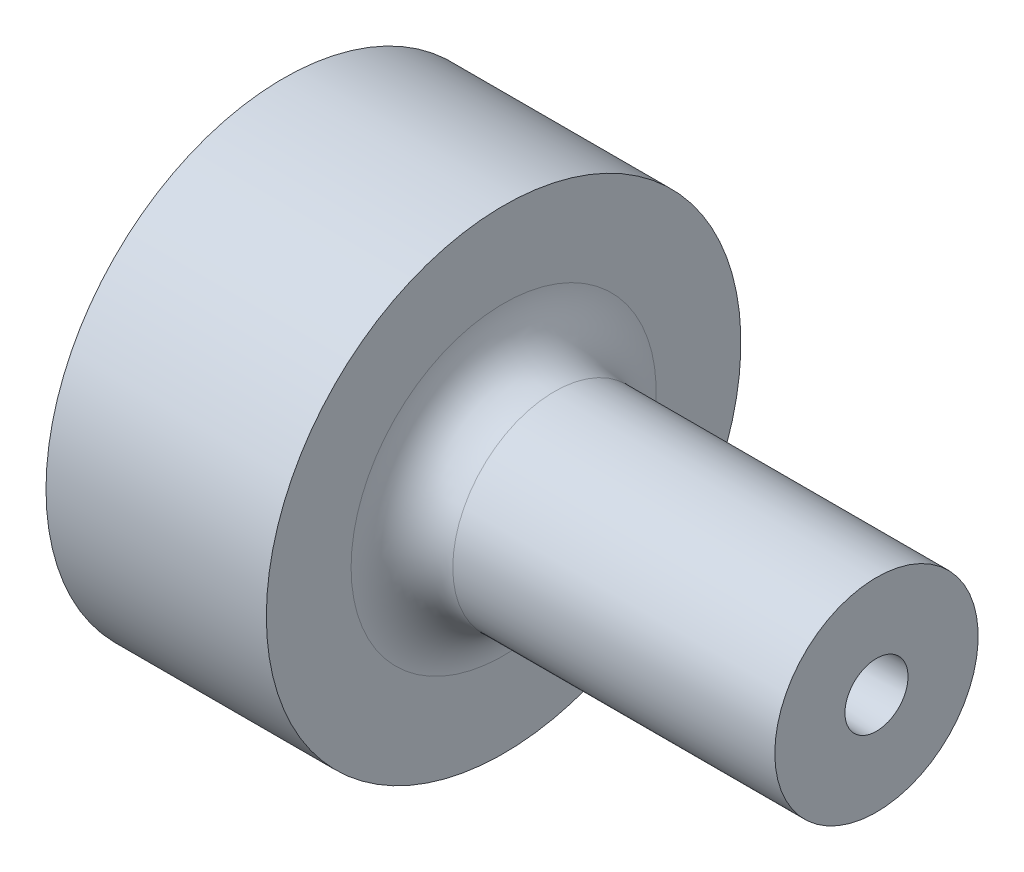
ISO-10303-21;
HEADER;
FILE_DESCRIPTION(('STEP AP214'),'2;1');
FILE_NAME('part.step','',(''),(''),'','','');
FILE_SCHEMA(('AUTOMOTIVE_DESIGN { 1 0 10303 214 1 1 1 1 }'));
ENDSEC;
DATA;
#1=APPLICATION_CONTEXT('core data for automotive mechanical design processes');
#2=APPLICATION_PROTOCOL_DEFINITION('international standard','automotive_design',2000,#1);
#3=PRODUCT_CONTEXT('',#1,'mechanical');
#4=PRODUCT('Part','Part','',(#3));
#5=PRODUCT_RELATED_PRODUCT_CATEGORY('part','',(#4));
#6=PRODUCT_DEFINITION_FORMATION('','',#4);
#7=PRODUCT_DEFINITION_CONTEXT('part definition',#1,'design');
#8=PRODUCT_DEFINITION('design','',#6,#7);
#9=PRODUCT_DEFINITION_SHAPE('','',#8);
#10=(LENGTH_UNIT() NAMED_UNIT(*) SI_UNIT(.MILLI.,.METRE.));
#11=(NAMED_UNIT(*) PLANE_ANGLE_UNIT() SI_UNIT($,.RADIAN.));
#12=(NAMED_UNIT(*) SI_UNIT($,.STERADIAN.) SOLID_ANGLE_UNIT());
#13=UNCERTAINTY_MEASURE_WITH_UNIT(LENGTH_MEASURE(1.E-05),#10,'distance_accuracy_value','');
#14=(GEOMETRIC_REPRESENTATION_CONTEXT(3) GLOBAL_UNCERTAINTY_ASSIGNED_CONTEXT((#13)) GLOBAL_UNIT_ASSIGNED_CONTEXT((#10,
#11,#12)) REPRESENTATION_CONTEXT('',''));
#15=CARTESIAN_POINT('',(0.,0.,0.));
#16=DIRECTION('',(0.,0.,1.));
#17=DIRECTION('',(1.,0.,0.));
#18=AXIS2_PLACEMENT_3D('',#15,#16,#17);
#19=CARTESIAN_POINT('',(0.,0.,0.));
#20=DIRECTION('',(-1.,0.,0.));
#21=DIRECTION('',(0.,0.,1.));
#22=AXIS2_PLACEMENT_3D('',#19,#20,#21);
#23=CYLINDRICAL_SURFACE('',#22,14.);
#24=CARTESIAN_POINT('',(13.,0.,0.));
#25=DIRECTION('',(-1.,0.,0.));
#26=DIRECTION('',(0.,0.,1.));
#27=AXIS2_PLACEMENT_3D('',#24,#25,#26);
#28=CIRCLE('',#27,14.);
#29=CARTESIAN_POINT('',(13.,0.,14.));
#30=VERTEX_POINT('',#29);
#31=EDGE_CURVE('E88',#30,#30,#28,.T.);
#32=ORIENTED_EDGE('',*,*,#31,.T.);
#33=EDGE_LOOP('',(#32));
#34=FACE_BOUND('',#33,.T.);
#35=CARTESIAN_POINT('',(0.,0.,0.));
#36=DIRECTION('',(-1.,0.,0.));
#37=DIRECTION('',(0.,0.,1.));
#38=AXIS2_PLACEMENT_3D('',#35,#36,#37);
#39=CIRCLE('',#38,14.);
#40=CARTESIAN_POINT('',(0.,0.,14.));
#41=VERTEX_POINT('',#40);
#42=EDGE_CURVE('E83',#41,#41,#39,.T.);
#43=ORIENTED_EDGE('',*,*,#42,.F.);
#44=EDGE_LOOP('',(#43));
#45=FACE_BOUND('',#44,.T.);
#46=CARTESIAN_POINT('',(6.5,-13.856406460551,-2.));
#47=CARTESIAN_POINT('',(6.61172417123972,-13.8564082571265,-1.99999534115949));
#48=CARTESIAN_POINT('',(6.72351471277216,-13.8577723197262,-1.99060664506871));
#49=CARTESIAN_POINT('',(6.9439746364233,-13.8630779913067,-1.95330740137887));
#50=CARTESIAN_POINT('',(7.05264079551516,-13.8670221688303,-1.92537839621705));
#51=CARTESIAN_POINT('',(7.26362870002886,-13.8770324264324,-1.85184738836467));
#52=CARTESIAN_POINT('',(7.36595507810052,-13.8830969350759,-1.80625847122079));
#53=CARTESIAN_POINT('',(7.56148972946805,-13.8966626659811,-1.69873175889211));
#54=CARTESIAN_POINT('',(7.65469934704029,-13.9041636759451,-1.63679637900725));
#55=CARTESIAN_POINT('',(7.83004829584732,-13.9198182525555,-1.49785346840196));
#56=CARTESIAN_POINT('',(7.91211171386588,-13.9279757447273,-1.42075056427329));
#57=CARTESIAN_POINT('',(8.06218155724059,-13.9439890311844,-1.25386707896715));
#58=CARTESIAN_POINT('',(8.13018723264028,-13.9518448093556,-1.16408582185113));
#59=CARTESIAN_POINT('',(8.25048909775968,-13.9664103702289,-0.973910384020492));
#60=CARTESIAN_POINT('',(8.30271571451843,-13.9731150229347,-0.873471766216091));
#61=CARTESIAN_POINT('',(8.38953073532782,-13.9845795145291,-0.665136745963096));
#62=CARTESIAN_POINT('',(8.4241199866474,-13.9893394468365,-0.557240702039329));
#63=CARTESIAN_POINT('',(8.47444920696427,-13.9963505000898,-0.337834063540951));
#64=CARTESIAN_POINT('',(8.49031606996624,-13.9986185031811,-0.226353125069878));
#65=CARTESIAN_POINT('',(8.5031438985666,-14.0004479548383,-0.00228956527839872));
#66=CARTESIAN_POINT('',(8.50010582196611,-14.0000095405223,0.110292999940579));
#67=CARTESIAN_POINT('',(8.47531062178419,-13.9964890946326,0.33249899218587));
#68=CARTESIAN_POINT('',(8.45369000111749,-13.9934263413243,0.442137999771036));
#69=CARTESIAN_POINT('',(8.39255744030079,-13.9850228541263,0.656215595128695));
#70=CARTESIAN_POINT('',(8.3530450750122,-13.9796820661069,0.760654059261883));
#71=CARTESIAN_POINT('',(8.25710925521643,-13.9672894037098,0.961781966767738));
#72=CARTESIAN_POINT('',(8.20062784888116,-13.9602316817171,1.05844339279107));
#73=CARTESIAN_POINT('',(8.07239950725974,-13.9451926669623,1.24096782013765));
#74=CARTESIAN_POINT('',(8.00065165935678,-13.9372113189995,1.32683017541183));
#75=CARTESIAN_POINT('',(7.843165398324,-13.921132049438,1.48612299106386));
#76=CARTESIAN_POINT('',(7.75730786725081,-13.9130337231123,1.55943569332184));
#77=CARTESIAN_POINT('',(7.57444547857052,-13.8977029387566,1.69062989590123));
#78=CARTESIAN_POINT('',(7.47744056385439,-13.890470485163,1.74851131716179));
#79=CARTESIAN_POINT('',(7.27491971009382,-13.8776905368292,1.84721301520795));
#80=CARTESIAN_POINT('',(7.1693981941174,-13.8721441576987,1.88802200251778));
#81=CARTESIAN_POINT('',(6.95290242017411,-13.8633846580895,1.9513062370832));
#82=CARTESIAN_POINT('',(6.84192850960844,-13.8601713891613,1.97378265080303));
#83=CARTESIAN_POINT('',(6.61872346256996,-13.8564698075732,1.99960390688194));
#84=CARTESIAN_POINT('',(6.50651197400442,-13.8559577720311,2.00311531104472));
#85=CARTESIAN_POINT('',(6.28310219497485,-13.8576537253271,1.9913480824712));
#86=CARTESIAN_POINT('',(6.17190387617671,-13.8598616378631,1.9760699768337));
#87=CARTESIAN_POINT('',(5.95418781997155,-13.8667269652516,1.92729837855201));
#88=CARTESIAN_POINT('',(5.84765127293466,-13.8713733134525,1.8938871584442));
#89=CARTESIAN_POINT('',(5.6416912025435,-13.8825829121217,1.80988306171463));
#90=CARTESIAN_POINT('',(5.54226800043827,-13.8891462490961,1.75928940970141));
#91=CARTESIAN_POINT('',(5.35260812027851,-13.9035064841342,1.64195360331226));
#92=CARTESIAN_POINT('',(5.26243903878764,-13.911311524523,1.57510320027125));
#93=CARTESIAN_POINT('',(5.09454027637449,-13.9272509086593,1.42730277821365));
#94=CARTESIAN_POINT('',(5.01681123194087,-13.9353852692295,1.34635203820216));
#95=CARTESIAN_POINT('',(4.8754047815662,-13.9511405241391,1.17191708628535));
#96=CARTESIAN_POINT('',(4.81183747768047,-13.9587570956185,1.07834317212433));
#97=CARTESIAN_POINT('',(4.70132443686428,-13.972552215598,0.881748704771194));
#98=CARTESIAN_POINT('',(4.65437828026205,-13.9787308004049,0.778728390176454));
#99=CARTESIAN_POINT('',(4.57861788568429,-13.9889347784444,0.566515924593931));
#100=CARTESIAN_POINT('',(4.54974241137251,-13.9929674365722,0.457345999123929));
#101=CARTESIAN_POINT('',(4.51074453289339,-13.9984555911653,0.235645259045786));
#102=CARTESIAN_POINT('',(4.50062101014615,-13.9999112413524,0.123114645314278));
#103=CARTESIAN_POINT('',(4.49943976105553,-14.0000800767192,-0.101043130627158));
#104=CARTESIAN_POINT('',(4.50821318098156,-13.998817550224,-0.212669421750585));
#105=CARTESIAN_POINT('',(4.54421615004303,-13.9937406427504,-0.432842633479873));
#106=CARTESIAN_POINT('',(4.57144565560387,-13.989926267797,-0.541389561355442));
#107=CARTESIAN_POINT('',(4.6435299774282,-13.9801722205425,-0.752283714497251));
#108=CARTESIAN_POINT('',(4.68837418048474,-13.9742338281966,-0.854634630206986));
#109=CARTESIAN_POINT('',(4.79439714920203,-13.960885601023,-1.05038570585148));
#110=CARTESIAN_POINT('',(4.8555763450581,-13.9534757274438,-1.14378562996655));
#111=CARTESIAN_POINT('',(4.99314771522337,-13.9379304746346,-1.31984194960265));
#112=CARTESIAN_POINT('',(5.06966490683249,-13.9297894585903,-1.40240016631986));
#113=CARTESIAN_POINT('',(5.2354775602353,-13.9137422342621,-1.55356716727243));
#114=CARTESIAN_POINT('',(5.32477602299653,-13.9058360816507,-1.6221726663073));
#115=CARTESIAN_POINT('',(5.51414543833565,-13.8911108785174,-1.74379523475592));
#116=CARTESIAN_POINT('',(5.61426869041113,-13.8842975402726,-1.79673154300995));
#117=CARTESIAN_POINT('',(5.82203229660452,-13.8725962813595,-1.88495902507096));
#118=CARTESIAN_POINT('',(5.92966459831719,-13.8677063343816,-1.92026877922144));
#119=CARTESIAN_POINT('',(6.11483642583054,-13.8615529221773,-1.96409255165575));
#120=CARTESIAN_POINT('',(6.19122433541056,-13.859633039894,-1.97753762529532));
#121=CARTESIAN_POINT('',(6.34506419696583,-13.857059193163,-1.99549291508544));
#122=CARTESIAN_POINT('',(6.42251613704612,-13.8564052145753,-2.00000323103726));
#123=CARTESIAN_POINT('',(6.5,-13.856406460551,-2.));
#124=B_SPLINE_CURVE_WITH_KNOTS('',3,(#46,#47,#48,#49,#50,#51,#52,#53,#54,#55,#56,#57,#58,#59,
#60,#61,#62,#63,#64,#65,#66,#67,#68,#69,#70,#71,#72,#73,#74,#75,#76,#77,#78,#79,#80,#81,#82,#83,
#84,#85,#86,#87,#88,#89,#90,#91,#92,#93,#94,#95,#96,#97,#98,#99,#100,#101,#102,#103,#104,#105,
#106,#107,#108,#109,#110,#111,#112,#113,#114,#115,#116,#117,#118,#119,#120,#121,#122,#123),
.UNSPECIFIED.,.T.,.F.,(4,2,2,2,2,2,2,2,2,2,2,2,2,2,2,2,2,2,2,2,2,2,2,2,2,2,2,2,2,2,2,2,2,2,2,2,
2,2,4),(0.,0.334889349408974,0.670112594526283,1.00508792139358,1.34001378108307,
1.6771171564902,2.01423851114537,2.35282530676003,2.6913958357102,3.02765822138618,
3.36390357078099,3.69769984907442,4.03150405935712,4.36646147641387,4.70143892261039,
5.03940517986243,5.37737316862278,5.7155642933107,6.05373389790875,6.3889286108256,
6.72411392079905,7.05779100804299,7.39148315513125,7.72746121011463,8.06345644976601,
8.40197921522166,8.74049343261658,9.07785422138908,9.41519488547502,9.74953375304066,
10.083871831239,10.4180087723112,10.7521545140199,11.0891434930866,11.426211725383,
11.7649881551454,12.103406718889,12.3356645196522,12.5679197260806),.UNSPECIFIED.);
#125=CARTESIAN_POINT('',(6.5,-13.856406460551,-2.));
#126=VERTEX_POINT('',#125);
#127=EDGE_CURVE('E9',#126,#126,#124,.T.);
#128=ORIENTED_EDGE('',*,*,#127,.F.);
#129=EDGE_LOOP('',(#128));
#130=FACE_BOUND('',#129,.T.);
#131=ADVANCED_FACE('F15',(#34,#45,#130),#23,.T.);
#132=CARTESIAN_POINT('',(0.,0.,0.));
#133=DIRECTION('',(1.,0.,0.));
#134=DIRECTION('',(0.,0.,-1.));
#135=AXIS2_PLACEMENT_3D('',#132,#133,#134);
#136=CONICAL_SURFACE('',#135,1.25,0.0174532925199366);
#137=CARTESIAN_POINT('',(35.,0.,0.));
#138=DIRECTION('',(-1.,0.,0.));
#139=DIRECTION('',(0.,0.,1.));
#140=AXIS2_PLACEMENT_3D('',#137,#138,#139);
#141=CIRCLE('',#140,1.86092727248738);
#142=CARTESIAN_POINT('',(35.,0.,1.86092727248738));
#143=VERTEX_POINT('',#142);
#144=EDGE_CURVE('E80',#143,#143,#141,.T.);
#145=ORIENTED_EDGE('',*,*,#144,.F.);
#146=EDGE_LOOP('',(#145));
#147=FACE_BOUND('',#146,.T.);
#148=CARTESIAN_POINT('',(0.924407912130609,0.,0.));
#149=DIRECTION('',(-1.,0.,0.));
#150=DIRECTION('',(0.,0.,1.));
#151=AXIS2_PLACEMENT_3D('',#148,#149,#150);
#152=CIRCLE('',#151,1.26613560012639);
#153=CARTESIAN_POINT('',(0.924407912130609,0.,1.26613560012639));
#154=VERTEX_POINT('',#153);
#155=EDGE_CURVE('E93',#154,#154,#152,.F.);
#156=ORIENTED_EDGE('',*,*,#155,.F.);
#157=EDGE_LOOP('',(#156));
#158=FACE_BOUND('',#157,.T.);
#159=ADVANCED_FACE('F44',(#147,#158),#136,.F.);
#160=CARTESIAN_POINT('',(16.,0.,0.));
#161=DIRECTION('',(-1.,0.,0.));
#162=DIRECTION('',(0.,0.,1.));
#163=AXIS2_PLACEMENT_3D('',#160,#161,#162);
#164=TOROIDAL_SURFACE('',#163,9.,3.);
#165=CARTESIAN_POINT('',(13.,0.,0.));
#166=DIRECTION('',(-1.,0.,0.));
#167=DIRECTION('',(0.,0.,1.));
#168=AXIS2_PLACEMENT_3D('',#165,#166,#167);
#169=CIRCLE('',#168,9.);
#170=CARTESIAN_POINT('',(13.,0.,9.));
#171=VERTEX_POINT('',#170);
#172=EDGE_CURVE('E90',#171,#171,#169,.T.);
#173=ORIENTED_EDGE('',*,*,#172,.F.);
#174=EDGE_LOOP('',(#173));
#175=FACE_BOUND('',#174,.T.);
#176=CARTESIAN_POINT('',(16.,0.,0.));
#177=DIRECTION('',(-1.,0.,0.));
#178=DIRECTION('',(0.,0.,1.));
#179=AXIS2_PLACEMENT_3D('',#176,#177,#178);
#180=CIRCLE('',#179,6.);
#181=CARTESIAN_POINT('',(16.,0.,6.));
#182=VERTEX_POINT('',#181);
#183=EDGE_CURVE('E27',#182,#182,#180,.T.);
#184=ORIENTED_EDGE('',*,*,#183,.T.);
#185=EDGE_LOOP('',(#184));
#186=FACE_BOUND('',#185,.T.);
#187=ADVANCED_FACE('F17',(#175,#186),#164,.F.);
#188=CARTESIAN_POINT('',(0.,0.,0.));
#189=DIRECTION('',(-1.,0.,0.));
#190=DIRECTION('',(0.,0.,1.));
#191=AXIS2_PLACEMENT_3D('',#188,#189,#190);
#192=CYLINDRICAL_SURFACE('',#191,6.);
#193=ORIENTED_EDGE('',*,*,#183,.F.);
#194=EDGE_LOOP('',(#193));
#195=FACE_BOUND('',#194,.T.);
#196=CARTESIAN_POINT('',(35.,0.,0.));
#197=DIRECTION('',(-1.,0.,0.));
#198=DIRECTION('',(0.,0.,1.));
#199=AXIS2_PLACEMENT_3D('',#196,#197,#198);
#200=CIRCLE('',#199,6.);
#201=CARTESIAN_POINT('',(35.,0.,6.));
#202=VERTEX_POINT('',#201);
#203=EDGE_CURVE('E79',#202,#202,#200,.T.);
#204=ORIENTED_EDGE('',*,*,#203,.T.);
#205=EDGE_LOOP('',(#204));
#206=FACE_BOUND('',#205,.T.);
#207=ADVANCED_FACE('F65',(#195,#206),#192,.T.);
#208=CARTESIAN_POINT('',(35.,6.,0.));
#209=DIRECTION('',(-1.,0.,0.));
#210=DIRECTION('',(0.,0.,1.));
#211=AXIS2_PLACEMENT_3D('',#208,#209,#210);
#212=PLANE('',#211);
#213=ORIENTED_EDGE('',*,*,#203,.F.);
#214=EDGE_LOOP('',(#213));
#215=FACE_BOUND('',#214,.T.);
#216=ORIENTED_EDGE('',*,*,#144,.T.);
#217=EDGE_LOOP('',(#216));
#218=FACE_BOUND('',#217,.T.);
#219=ADVANCED_FACE('F61',(#215,#218),#212,.F.);
#220=CARTESIAN_POINT('',(0.,1.25,0.));
#221=DIRECTION('',(1.,0.,0.));
#222=DIRECTION('',(0.,0.,-1.));
#223=AXIS2_PLACEMENT_3D('',#220,#221,#222);
#224=PLANE('',#223);
#225=CARTESIAN_POINT('',(0.,0.,0.));
#226=DIRECTION('',(-1.,0.,0.));
#227=DIRECTION('',(0.,0.,1.));
#228=AXIS2_PLACEMENT_3D('',#225,#226,#227);
#229=CIRCLE('',#228,5.);
#230=CARTESIAN_POINT('',(0.,0.,5.));
#231=VERTEX_POINT('',#230);
#232=EDGE_CURVE('E96',#231,#231,#229,.T.);
#233=ORIENTED_EDGE('',*,*,#232,.F.);
#234=EDGE_LOOP('',(#233));
#235=FACE_BOUND('',#234,.T.);
#236=ORIENTED_EDGE('',*,*,#42,.T.);
#237=EDGE_LOOP('',(#236));
#238=FACE_BOUND('',#237,.T.);
#239=ADVANCED_FACE('F59',(#235,#238),#224,.F.);
#240=CARTESIAN_POINT('',(13.,14.,0.));
#241=DIRECTION('',(-1.,0.,0.));
#242=DIRECTION('',(0.,0.,1.));
#243=AXIS2_PLACEMENT_3D('',#240,#241,#242);
#244=PLANE('',#243);
#245=ORIENTED_EDGE('',*,*,#31,.F.);
#246=EDGE_LOOP('',(#245));
#247=FACE_BOUND('',#246,.T.);
#248=ORIENTED_EDGE('',*,*,#172,.T.);
#249=EDGE_LOOP('',(#248));
#250=FACE_BOUND('',#249,.T.);
#251=ADVANCED_FACE('F57',(#247,#250),#244,.F.);
#252=CARTESIAN_POINT('',(-14.4672767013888,0.,0.));
#253=DIRECTION('',(-1.,0.,0.));
#254=DIRECTION('',(0.,0.,1.));
#255=AXIS2_PLACEMENT_3D('',#252,#253,#254);
#256=DEGENERATE_TOROIDAL_SURFACE('',#255,0.56308411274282,15.5,.F.);
#257=ORIENTED_EDGE('',*,*,#232,.T.);
#258=EDGE_LOOP('',(#257));
#259=FACE_BOUND('',#258,.T.);
#260=ORIENTED_EDGE('',*,*,#155,.T.);
#261=EDGE_LOOP('',(#260));
#262=FACE_BOUND('',#261,.T.);
#263=ADVANCED_FACE('F40',(#259,#262),#256,.T.);
#264=CARTESIAN_POINT('',(6.5,-14.,0.));
#265=DIRECTION('',(0.,-1.,0.));
#266=DIRECTION('',(0.,0.,-1.));
#267=AXIS2_PLACEMENT_3D('',#264,#265,#266);
#268=CYLINDRICAL_SURFACE('',#267,2.);
#269=CARTESIAN_POINT('',(6.5,-8.,0.));
#270=DIRECTION('',(0.,-1.,0.));
#271=DIRECTION('',(0.,0.,-1.));
#272=AXIS2_PLACEMENT_3D('',#269,#270,#271);
#273=CIRCLE('',#272,2.);
#274=CARTESIAN_POINT('',(6.5,-8.,-2.));
#275=VERTEX_POINT('',#274);
#276=EDGE_CURVE('E99',#275,#275,#273,.T.);
#277=ORIENTED_EDGE('',*,*,#276,.F.);
#278=EDGE_LOOP('',(#277));
#279=FACE_BOUND('',#278,.T.);
#280=ORIENTED_EDGE('',*,*,#127,.T.);
#281=EDGE_LOOP('',(#280));
#282=FACE_BOUND('',#281,.T.);
#283=ADVANCED_FACE('F32',(#279,#282),#268,.F.);
#284=CARTESIAN_POINT('',(6.5,-6.84529946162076,0.));
#285=DIRECTION('',(0.,-1.,0.));
#286=DIRECTION('',(0.,0.,-1.));
#287=AXIS2_PLACEMENT_3D('',#284,#285,#286);
#288=CONICAL_SURFACE('',#287,0.,1.0471975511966);
#289=ORIENTED_EDGE('',*,*,#276,.T.);
#290=EDGE_LOOP('',(#289));
#291=FACE_BOUND('',#290,.T.);
#292=CARTESIAN_POINT('',(6.5,-6.84529946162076,0.));
#293=VERTEX_POINT('',#292);
#294=VERTEX_LOOP('',#293);
#295=FACE_BOUND('',#294,.T.);
#296=ADVANCED_FACE('F30',(#291,#295),#288,.F.);
#297=CLOSED_SHELL('',(#131,#159,#187,#207,#219,#239,#251,#263,#283,#296));
#298=MANIFOLD_SOLID_BREP('B1',#297);
#299=ADVANCED_BREP_SHAPE_REPRESENTATION('',(#18,#298),#14);
#300=SHAPE_DEFINITION_REPRESENTATION(#9,#299);
ENDSEC;
END-ISO-10303-21;
